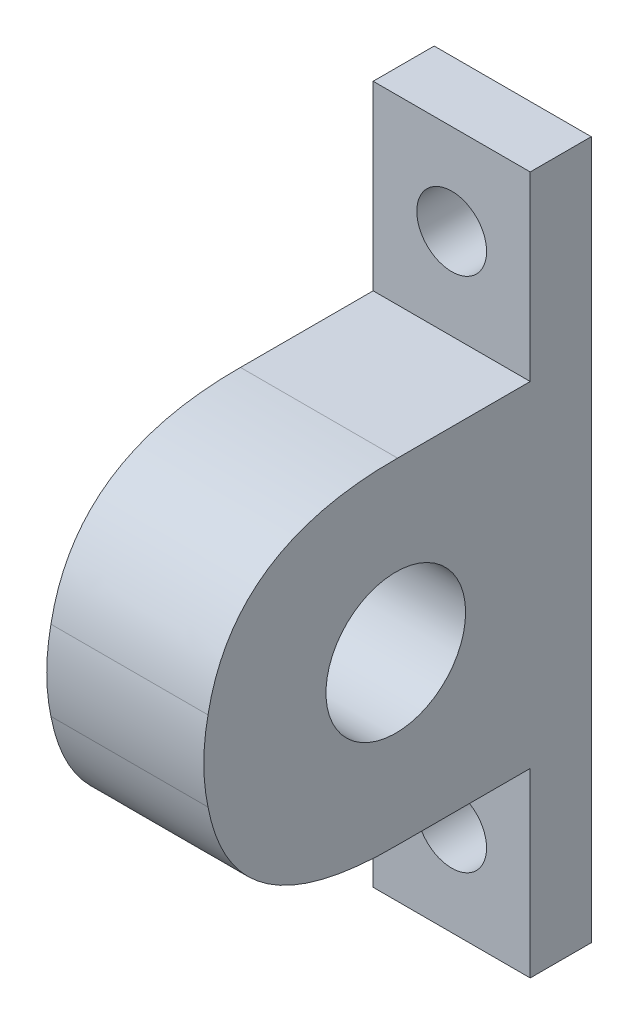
ISO-10303-21;
HEADER;
FILE_DESCRIPTION(('STEP AP214'),'2;1');
FILE_NAME('part.step','',(''),(''),'','','');
FILE_SCHEMA(('AUTOMOTIVE_DESIGN { 1 0 10303 214 1 1 1 1 }'));
ENDSEC;
DATA;
#1=APPLICATION_CONTEXT('core data for automotive mechanical design processes');
#2=APPLICATION_PROTOCOL_DEFINITION('international standard','automotive_design',2000,#1);
#3=PRODUCT_CONTEXT('',#1,'mechanical');
#4=PRODUCT('Part','Part','',(#3));
#5=PRODUCT_RELATED_PRODUCT_CATEGORY('part','',(#4));
#6=PRODUCT_DEFINITION_FORMATION('','',#4);
#7=PRODUCT_DEFINITION_CONTEXT('part definition',#1,'design');
#8=PRODUCT_DEFINITION('design','',#6,#7);
#9=PRODUCT_DEFINITION_SHAPE('','',#8);
#10=(LENGTH_UNIT() NAMED_UNIT(*) SI_UNIT(.MILLI.,.METRE.));
#11=(NAMED_UNIT(*) PLANE_ANGLE_UNIT() SI_UNIT($,.RADIAN.));
#12=(NAMED_UNIT(*) SI_UNIT($,.STERADIAN.) SOLID_ANGLE_UNIT());
#13=UNCERTAINTY_MEASURE_WITH_UNIT(LENGTH_MEASURE(1.E-05),#10,'distance_accuracy_value','');
#14=(GEOMETRIC_REPRESENTATION_CONTEXT(3) GLOBAL_UNCERTAINTY_ASSIGNED_CONTEXT((#13)) GLOBAL_UNIT_ASSIGNED_CONTEXT((#10,
#11,#12)) REPRESENTATION_CONTEXT('',''));
#15=CARTESIAN_POINT('',(0.,0.,0.));
#16=DIRECTION('',(0.,0.,1.));
#17=DIRECTION('',(1.,0.,0.));
#18=AXIS2_PLACEMENT_3D('',#15,#16,#17);
#19=CARTESIAN_POINT('',(22.5,-50.,8.7420219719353));
#20=DIRECTION('',(1.,0.,0.));
#21=DIRECTION('',(0.,0.,-1.));
#22=AXIS2_PLACEMENT_3D('',#19,#20,#21);
#23=PLANE('',#22);
#24=CARTESIAN_POINT('',(22.5,0.,28.));
#25=DIRECTION('',(1.,0.,0.));
#26=DIRECTION('',(0.,0.,-1.));
#27=AXIS2_PLACEMENT_3D('',#24,#25,#26);
#28=CIRCLE('',#27,10.);
#29=CARTESIAN_POINT('',(22.5,0.,18.));
#30=VERTEX_POINT('',#29);
#31=EDGE_CURVE('E51',#30,#30,#28,.F.);
#32=ORIENTED_EDGE('',*,*,#31,.T.);
#33=EDGE_LOOP('',(#32));
#34=FACE_BOUND('',#33,.T.);
#35=DIRECTION('',(0.,-1.,0.));
#36=VECTOR('',#35,1.);
#37=CARTESIAN_POINT('',(22.5,0.,8.7420219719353));
#38=LINE('',#37,#36);
#39=CARTESIAN_POINT('',(22.5,-24.,8.7420219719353));
#40=VERTEX_POINT('',#39);
#41=CARTESIAN_POINT('',(22.5,-50.,8.7420219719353));
#42=VERTEX_POINT('',#41);
#43=EDGE_CURVE('E223',#40,#42,#38,.T.);
#44=ORIENTED_EDGE('',*,*,#43,.T.);
#45=DIRECTION('',(0.,0.,-1.));
#46=VECTOR('',#45,1.);
#47=CARTESIAN_POINT('',(22.5,-50.,55.5));
#48=LINE('',#47,#46);
#49=CARTESIAN_POINT('',(22.5,-50.,0.));
#50=VERTEX_POINT('',#49);
#51=EDGE_CURVE('E146',#42,#50,#48,.T.);
#52=ORIENTED_EDGE('',*,*,#51,.T.);
#53=DIRECTION('',(0.,1.,0.));
#54=VECTOR('',#53,1.);
#55=CARTESIAN_POINT('',(22.5,-50.,0.));
#56=LINE('',#55,#54);
#57=CARTESIAN_POINT('',(22.5,50.,0.));
#58=VERTEX_POINT('',#57);
#59=EDGE_CURVE('E145',#50,#58,#56,.T.);
#60=ORIENTED_EDGE('',*,*,#59,.T.);
#61=DIRECTION('',(0.,0.,-1.));
#62=VECTOR('',#61,1.);
#63=CARTESIAN_POINT('',(22.5,50.,55.5));
#64=LINE('',#63,#62);
#65=CARTESIAN_POINT('',(22.5,50.,8.7420219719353));
#66=VERTEX_POINT('',#65);
#67=EDGE_CURVE('E135',#66,#58,#64,.T.);
#68=ORIENTED_EDGE('',*,*,#67,.F.);
#69=DIRECTION('',(0.,1.,0.));
#70=VECTOR('',#69,1.);
#71=CARTESIAN_POINT('',(22.5,0.,8.7420219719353));
#72=LINE('',#71,#70);
#73=CARTESIAN_POINT('',(22.5,24.,8.7420219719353));
#74=VERTEX_POINT('',#73);
#75=EDGE_CURVE('E174',#74,#66,#72,.T.);
#76=ORIENTED_EDGE('',*,*,#75,.F.);
#77=DIRECTION('',(0.,0.,1.));
#78=VECTOR('',#77,1.);
#79=CARTESIAN_POINT('',(22.5,24.,0.));
#80=LINE('',#79,#78);
#81=CARTESIAN_POINT('',(22.5,24.,27.75));
#82=VERTEX_POINT('',#81);
#83=EDGE_CURVE('E294',#74,#82,#80,.T.);
#84=ORIENTED_EDGE('',*,*,#83,.T.);
#85=CARTESIAN_POINT('',(22.5,0.,55.5));
#86=CARTESIAN_POINT('',(22.5,24.2004229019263,54.7772443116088));
#87=CARTESIAN_POINT('',(22.5,24.,27.75));
#88=B_SPLINE_CURVE_WITH_KNOTS('',2,(#85,#86,#87),.UNSPECIFIED.,.F.,.F.,(3,3),(0.,1.),.UNSPECIFIED.);
#89=CARTESIAN_POINT('',(22.5,5.71932993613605,54.8986851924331));
#90=VERTEX_POINT('',#89);
#91=EDGE_CURVE('E166',#90,#82,#88,.T.);
#92=ORIENTED_EDGE('',*,*,#91,.F.);
#93=CARTESIAN_POINT('',(22.5,0.,28.));
#94=DIRECTION('',(1.,0.,0.));
#95=DIRECTION('',(0.,0.,-1.));
#96=AXIS2_PLACEMENT_3D('',#93,#94,#95);
#97=CIRCLE('',#96,27.5);
#98=CARTESIAN_POINT('',(22.5,-5.7193299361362,54.898685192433));
#99=VERTEX_POINT('',#98);
#100=EDGE_CURVE('E162',#90,#99,#97,.T.);
#101=ORIENTED_EDGE('',*,*,#100,.T.);
#102=CARTESIAN_POINT('',(22.5,0.,55.5));
#103=CARTESIAN_POINT('',(22.5,-24.2004229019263,54.7772443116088));
#104=CARTESIAN_POINT('',(22.5,-24.,27.75));
#105=B_SPLINE_CURVE_WITH_KNOTS('',2,(#102,#103,#104),.UNSPECIFIED.,.F.,.F.,(3,3),(0.,1.),.UNSPECIFIED.);
#106=CARTESIAN_POINT('',(22.5,-24.,27.75));
#107=VERTEX_POINT('',#106);
#108=EDGE_CURVE('E321',#99,#107,#105,.T.);
#109=ORIENTED_EDGE('',*,*,#108,.T.);
#110=DIRECTION('',(0.,0.,1.));
#111=VECTOR('',#110,1.);
#112=CARTESIAN_POINT('',(22.5,-24.,0.));
#113=LINE('',#112,#111);
#114=EDGE_CURVE('E233',#40,#107,#113,.T.);
#115=ORIENTED_EDGE('',*,*,#114,.F.);
#116=EDGE_LOOP('',(#44,#52,#60,#68,#76,#84,#92,#101,#109,#115));
#117=FACE_BOUND('',#116,.T.);
#118=ADVANCED_FACE('F47',(#34,#117),#23,.T.);
#119=CARTESIAN_POINT('',(0.,0.,28.));
#120=DIRECTION('',(1.,0.,0.));
#121=DIRECTION('',(0.,0.,-1.));
#122=AXIS2_PLACEMENT_3D('',#119,#120,#121);
#123=CYLINDRICAL_SURFACE('',#122,10.);
#124=CARTESIAN_POINT('',(-5.,0.,28.));
#125=DIRECTION('',(-1.,0.,0.));
#126=DIRECTION('',(0.,0.,1.));
#127=AXIS2_PLACEMENT_3D('',#124,#125,#126);
#128=CIRCLE('',#127,10.);
#129=CARTESIAN_POINT('',(-5.,0.,18.));
#130=VERTEX_POINT('',#129);
#131=EDGE_CURVE('E11',#130,#130,#128,.F.);
#132=CARTESIAN_POINT('',(-5.,0.,18.));
#133=CARTESIAN_POINT('',(-4.71354166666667,0.,18.));
#134=CARTESIAN_POINT('',(-4.42708333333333,0.,18.));
#135=CARTESIAN_POINT('',(-3.85416666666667,0.,18.));
#136=CARTESIAN_POINT('',(-3.56770833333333,0.,18.));
#137=CARTESIAN_POINT('',(-2.99479166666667,0.,18.));
#138=CARTESIAN_POINT('',(-2.70833333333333,0.,18.));
#139=CARTESIAN_POINT('',(-2.13541666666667,0.,18.));
#140=CARTESIAN_POINT('',(-1.84895833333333,0.,18.));
#141=CARTESIAN_POINT('',(-1.27604166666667,0.,18.));
#142=CARTESIAN_POINT('',(-0.989583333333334,0.,18.));
#143=CARTESIAN_POINT('',(-0.416666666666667,0.,18.));
#144=CARTESIAN_POINT('',(-0.130208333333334,0.,18.));
#145=CARTESIAN_POINT('',(0.442708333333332,0.,18.));
#146=CARTESIAN_POINT('',(0.729166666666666,0.,18.));
#147=CARTESIAN_POINT('',(1.30208333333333,0.,18.));
#148=CARTESIAN_POINT('',(1.58854166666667,0.,18.));
#149=CARTESIAN_POINT('',(2.16145833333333,0.,18.));
#150=CARTESIAN_POINT('',(2.44791666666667,0.,18.));
#151=CARTESIAN_POINT('',(3.02083333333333,0.,18.));
#152=CARTESIAN_POINT('',(3.30729166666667,0.,18.));
#153=CARTESIAN_POINT('',(3.88020833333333,0.,18.));
#154=CARTESIAN_POINT('',(4.16666666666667,0.,18.));
#155=CARTESIAN_POINT('',(4.73958333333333,0.,18.));
#156=CARTESIAN_POINT('',(5.02604166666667,0.,18.));
#157=CARTESIAN_POINT('',(5.59895833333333,0.,18.));
#158=CARTESIAN_POINT('',(5.88541666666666,0.,18.));
#159=CARTESIAN_POINT('',(6.45833333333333,0.,18.));
#160=CARTESIAN_POINT('',(6.74479166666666,0.,18.));
#161=CARTESIAN_POINT('',(7.31770833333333,0.,18.));
#162=CARTESIAN_POINT('',(7.60416666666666,0.,18.));
#163=CARTESIAN_POINT('',(8.17708333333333,0.,18.));
#164=CARTESIAN_POINT('',(8.46354166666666,0.,18.));
#165=CARTESIAN_POINT('',(9.03645833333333,0.,18.));
#166=CARTESIAN_POINT('',(9.32291666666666,0.,18.));
#167=CARTESIAN_POINT('',(9.89583333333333,0.,18.));
#168=CARTESIAN_POINT('',(10.1822916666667,0.,18.));
#169=CARTESIAN_POINT('',(10.7552083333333,0.,18.));
#170=CARTESIAN_POINT('',(11.0416666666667,0.,18.));
#171=CARTESIAN_POINT('',(11.6145833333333,0.,18.));
#172=CARTESIAN_POINT('',(11.9010416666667,0.,18.));
#173=CARTESIAN_POINT('',(12.4739583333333,0.,18.));
#174=CARTESIAN_POINT('',(12.7604166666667,0.,18.));
#175=CARTESIAN_POINT('',(13.3333333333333,0.,18.));
#176=CARTESIAN_POINT('',(13.6197916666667,0.,18.));
#177=CARTESIAN_POINT('',(14.1927083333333,0.,18.));
#178=CARTESIAN_POINT('',(14.4791666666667,0.,18.));
#179=CARTESIAN_POINT('',(15.0520833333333,0.,18.));
#180=CARTESIAN_POINT('',(15.3385416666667,0.,18.));
#181=CARTESIAN_POINT('',(15.9114583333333,0.,18.));
#182=CARTESIAN_POINT('',(16.1979166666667,0.,18.));
#183=CARTESIAN_POINT('',(16.7708333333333,0.,18.));
#184=CARTESIAN_POINT('',(17.0572916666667,0.,18.));
#185=CARTESIAN_POINT('',(17.6302083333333,0.,18.));
#186=CARTESIAN_POINT('',(17.9166666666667,0.,18.));
#187=CARTESIAN_POINT('',(18.4895833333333,0.,18.));
#188=CARTESIAN_POINT('',(18.7760416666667,0.,18.));
#189=CARTESIAN_POINT('',(19.3489583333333,0.,18.));
#190=CARTESIAN_POINT('',(19.6354166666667,0.,18.));
#191=CARTESIAN_POINT('',(20.2083333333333,0.,18.));
#192=CARTESIAN_POINT('',(20.4947916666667,0.,18.));
#193=CARTESIAN_POINT('',(21.0677083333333,0.,18.));
#194=CARTESIAN_POINT('',(21.3541666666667,0.,18.));
#195=CARTESIAN_POINT('',(21.9270833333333,0.,18.));
#196=CARTESIAN_POINT('',(22.2135416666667,0.,18.));
#197=CARTESIAN_POINT('',(22.5,0.,18.));
#198=B_SPLINE_CURVE_WITH_KNOTS('',3,(#132,#133,#134,#135,#136,#137,#138,#139,#140,#141,#142,
#143,#144,#145,#146,#147,#148,#149,#150,#151,#152,#153,#154,#155,#156,#157,#158,#159,#160,#161,
#162,#163,#164,#165,#166,#167,#168,#169,#170,#171,#172,#173,#174,#175,#176,#177,#178,#179,#180,
#181,#182,#183,#184,#185,#186,#187,#188,#189,#190,#191,#192,#193,#194,#195,#196,#197),
.UNSPECIFIED.,.F.,.F.,(4,2,2,2,2,2,2,2,2,2,2,2,2,2,2,2,2,2,2,2,2,2,2,2,2,2,2,2,2,2,2,2,4),(0.,
0.859375,1.71875,2.578125,3.4375,4.296875,5.15625,6.015625,6.875,7.734375,8.59375,9.453125,
10.3125,11.171875,12.03125,12.890625,13.75,14.609375,15.46875,16.328125,17.1875,18.046875,
18.90625,19.765625,20.625,21.484375,22.34375,23.203125,24.0625,24.921875,25.78125,26.640625,
27.5),.UNSPECIFIED.);
#199=EDGE_CURVE('BSEAM49',#130,#30,#198,.T.);
#200=ORIENTED_EDGE('',*,*,#131,.F.);
#201=ORIENTED_EDGE('',*,*,#31,.F.);
#202=ORIENTED_EDGE('',*,*,#199,.T.);
#203=ORIENTED_EDGE('',*,*,#199,.F.);
#204=EDGE_LOOP('',(#200,#202,#201,#203));
#205=FACE_BOUND('',#204,.T.);
#206=ADVANCED_FACE('F49',(#205),#123,.F.);
#207=CARTESIAN_POINT('',(0.,-50.,55.5));
#208=DIRECTION('',(1.,0.,0.));
#209=DIRECTION('',(0.,0.,-1.));
#210=AXIS2_PLACEMENT_3D('',#207,#208,#209);
#211=PLANE('',#210);
#212=CARTESIAN_POINT('',(0.,0.,28.));
#213=DIRECTION('',(1.,0.,0.));
#214=DIRECTION('',(0.,0.,-1.));
#215=AXIS2_PLACEMENT_3D('',#212,#213,#214);
#216=CIRCLE('',#215,12.);
#217=CARTESIAN_POINT('',(0.,0.,16.));
#218=VERTEX_POINT('',#217);
#219=EDGE_CURVE('E254',#218,#218,#216,.F.);
#220=ORIENTED_EDGE('',*,*,#219,.F.);
#221=EDGE_LOOP('',(#220));
#222=FACE_BOUND('',#221,.T.);
#223=DIRECTION('',(0.,-1.,0.));
#224=VECTOR('',#223,1.);
#225=CARTESIAN_POINT('',(0.,0.,8.7420219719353));
#226=LINE('',#225,#224);
#227=CARTESIAN_POINT('',(0.,-24.,8.7420219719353));
#228=VERTEX_POINT('',#227);
#229=CARTESIAN_POINT('',(0.,-50.,8.7420219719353));
#230=VERTEX_POINT('',#229);
#231=EDGE_CURVE('E215',#228,#230,#226,.T.);
#232=ORIENTED_EDGE('',*,*,#231,.F.);
#233=DIRECTION('',(0.,0.,1.));
#234=VECTOR('',#233,1.);
#235=CARTESIAN_POINT('',(0.,-24.,0.));
#236=LINE('',#235,#234);
#237=CARTESIAN_POINT('',(0.,-24.,27.75));
#238=VERTEX_POINT('',#237);
#239=EDGE_CURVE('E214',#228,#238,#236,.T.);
#240=ORIENTED_EDGE('',*,*,#239,.T.);
#241=CARTESIAN_POINT('',(0.,0.,55.5));
#242=CARTESIAN_POINT('',(0.,-24.2004229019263,54.7772443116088));
#243=CARTESIAN_POINT('',(0.,-24.,27.75));
#244=B_SPLINE_CURVE_WITH_KNOTS('',2,(#241,#242,#243),.UNSPECIFIED.,.F.,.F.,(3,3),(0.,1.),.UNSPECIFIED.);
#245=CARTESIAN_POINT('',(0.,-5.7193299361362,54.898685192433));
#246=VERTEX_POINT('',#245);
#247=EDGE_CURVE('E89',#246,#238,#244,.T.);
#248=ORIENTED_EDGE('',*,*,#247,.F.);
#249=CARTESIAN_POINT('',(0.,0.,28.));
#250=DIRECTION('',(1.,0.,0.));
#251=DIRECTION('',(0.,0.,-1.));
#252=AXIS2_PLACEMENT_3D('',#249,#250,#251);
#253=CIRCLE('',#252,27.5);
#254=CARTESIAN_POINT('',(0.,5.71932993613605,54.8986851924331));
#255=VERTEX_POINT('',#254);
#256=EDGE_CURVE('E85',#255,#246,#253,.T.);
#257=ORIENTED_EDGE('',*,*,#256,.F.);
#258=CARTESIAN_POINT('',(0.,0.,55.5));
#259=CARTESIAN_POINT('',(0.,24.2004229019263,54.7772443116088));
#260=CARTESIAN_POINT('',(0.,24.,27.75));
#261=B_SPLINE_CURVE_WITH_KNOTS('',2,(#258,#259,#260),.UNSPECIFIED.,.F.,.F.,(3,3),(0.,1.),.UNSPECIFIED.);
#262=CARTESIAN_POINT('',(0.,24.,27.75));
#263=VERTEX_POINT('',#262);
#264=EDGE_CURVE('E173',#255,#263,#261,.T.);
#265=ORIENTED_EDGE('',*,*,#264,.T.);
#266=DIRECTION('',(0.,0.,1.));
#267=VECTOR('',#266,1.);
#268=CARTESIAN_POINT('',(0.,24.,0.));
#269=LINE('',#268,#267);
#270=CARTESIAN_POINT('',(0.,24.,8.7420219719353));
#271=VERTEX_POINT('',#270);
#272=EDGE_CURVE('E181',#271,#263,#269,.T.);
#273=ORIENTED_EDGE('',*,*,#272,.F.);
#274=DIRECTION('',(0.,1.,0.));
#275=VECTOR('',#274,1.);
#276=CARTESIAN_POINT('',(0.,0.,8.7420219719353));
#277=LINE('',#276,#275);
#278=CARTESIAN_POINT('',(0.,50.,8.7420219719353));
#279=VERTEX_POINT('',#278);
#280=EDGE_CURVE('E280',#271,#279,#277,.T.);
#281=ORIENTED_EDGE('',*,*,#280,.T.);
#282=DIRECTION('',(0.,0.,-1.));
#283=VECTOR('',#282,1.);
#284=CARTESIAN_POINT('',(0.,50.,55.5));
#285=LINE('',#284,#283);
#286=CARTESIAN_POINT('',(0.,50.,0.));
#287=VERTEX_POINT('',#286);
#288=EDGE_CURVE('E257',#279,#287,#285,.T.);
#289=ORIENTED_EDGE('',*,*,#288,.T.);
#290=DIRECTION('',(0.,-1.,0.));
#291=VECTOR('',#290,1.);
#292=CARTESIAN_POINT('',(0.,-50.,0.));
#293=LINE('',#292,#291);
#294=CARTESIAN_POINT('',(0.,-50.,0.));
#295=VERTEX_POINT('',#294);
#296=EDGE_CURVE('E160',#287,#295,#293,.T.);
#297=ORIENTED_EDGE('',*,*,#296,.T.);
#298=DIRECTION('',(0.,0.,-1.));
#299=VECTOR('',#298,1.);
#300=CARTESIAN_POINT('',(0.,-50.,55.5));
#301=LINE('',#300,#299);
#302=EDGE_CURVE('E261',#230,#295,#301,.T.);
#303=ORIENTED_EDGE('',*,*,#302,.F.);
#304=EDGE_LOOP('',(#232,#240,#248,#257,#265,#273,#281,#289,#297,#303));
#305=FACE_BOUND('',#304,.T.);
#306=ADVANCED_FACE('F276',(#222,#305),#211,.F.);
#307=CARTESIAN_POINT('',(0.,-50.,55.5));
#308=DIRECTION('',(0.,1.,0.));
#309=DIRECTION('',(0.,0.,1.));
#310=AXIS2_PLACEMENT_3D('',#307,#308,#309);
#311=PLANE('',#310);
#312=DIRECTION('',(1.,0.,0.));
#313=VECTOR('',#312,1.);
#314=CARTESIAN_POINT('',(0.,-50.,8.7420219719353));
#315=LINE('',#314,#313);
#316=EDGE_CURVE('E273',#230,#42,#315,.T.);
#317=ORIENTED_EDGE('',*,*,#316,.F.);
#318=ORIENTED_EDGE('',*,*,#302,.T.);
#319=DIRECTION('',(1.,0.,0.));
#320=VECTOR('',#319,1.);
#321=CARTESIAN_POINT('',(0.,-50.,0.));
#322=LINE('',#321,#320);
#323=EDGE_CURVE('E155',#295,#50,#322,.T.);
#324=ORIENTED_EDGE('',*,*,#323,.T.);
#325=ORIENTED_EDGE('',*,*,#51,.F.);
#326=EDGE_LOOP('',(#317,#318,#324,#325));
#327=FACE_BOUND('',#326,.T.);
#328=ADVANCED_FACE('F271',(#327),#311,.F.);
#329=CARTESIAN_POINT('',(22.5,50.,55.5));
#330=DIRECTION('',(0.,-1.,0.));
#331=DIRECTION('',(0.,0.,-1.));
#332=AXIS2_PLACEMENT_3D('',#329,#330,#331);
#333=PLANE('',#332);
#334=ORIENTED_EDGE('',*,*,#288,.F.);
#335=DIRECTION('',(1.,0.,0.));
#336=VECTOR('',#335,1.);
#337=CARTESIAN_POINT('',(0.,50.,8.7420219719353));
#338=LINE('',#337,#336);
#339=EDGE_CURVE('E141',#279,#66,#338,.T.);
#340=ORIENTED_EDGE('',*,*,#339,.T.);
#341=ORIENTED_EDGE('',*,*,#67,.T.);
#342=DIRECTION('',(-1.,0.,0.));
#343=VECTOR('',#342,1.);
#344=CARTESIAN_POINT('',(22.5,50.,0.));
#345=LINE('',#344,#343);
#346=EDGE_CURVE('E140',#58,#287,#345,.T.);
#347=ORIENTED_EDGE('',*,*,#346,.T.);
#348=EDGE_LOOP('',(#334,#340,#341,#347));
#349=FACE_BOUND('',#348,.T.);
#350=ADVANCED_FACE('F138',(#349),#333,.F.);
#351=CARTESIAN_POINT('',(0.,0.,0.));
#352=DIRECTION('',(0.,0.,-1.));
#353=DIRECTION('',(-1.,0.,0.));
#354=AXIS2_PLACEMENT_3D('',#351,#352,#353);
#355=PLANE('',#354);
#356=CARTESIAN_POINT('',(11.25,-37.,0.));
#357=DIRECTION('',(0.,0.,1.));
#358=DIRECTION('',(1.,0.,0.));
#359=AXIS2_PLACEMENT_3D('',#356,#357,#358);
#360=CIRCLE('',#359,4.99843798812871);
#361=CARTESIAN_POINT('',(16.2484379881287,-37.,0.));
#362=VERTEX_POINT('',#361);
#363=EDGE_CURVE('E228',#362,#362,#360,.T.);
#364=ORIENTED_EDGE('',*,*,#363,.T.);
#365=EDGE_LOOP('',(#364));
#366=FACE_BOUND('',#365,.T.);
#367=CARTESIAN_POINT('',(11.25,37.,0.));
#368=DIRECTION('',(0.,0.,1.));
#369=DIRECTION('',(1.,0.,0.));
#370=AXIS2_PLACEMENT_3D('',#367,#368,#369);
#371=CIRCLE('',#370,5.);
#372=CARTESIAN_POINT('',(16.25,37.,0.));
#373=VERTEX_POINT('',#372);
#374=EDGE_CURVE('E229',#373,#373,#371,.T.);
#375=ORIENTED_EDGE('',*,*,#374,.T.);
#376=EDGE_LOOP('',(#375));
#377=FACE_BOUND('',#376,.T.);
#378=ORIENTED_EDGE('',*,*,#346,.F.);
#379=ORIENTED_EDGE('',*,*,#59,.F.);
#380=ORIENTED_EDGE('',*,*,#323,.F.);
#381=ORIENTED_EDGE('',*,*,#296,.F.);
#382=EDGE_LOOP('',(#378,#379,#380,#381));
#383=FACE_BOUND('',#382,.T.);
#384=ADVANCED_FACE('F158',(#366,#377,#383),#355,.T.);
#385=CARTESIAN_POINT('',(0.,0.,28.));
#386=DIRECTION('',(1.,0.,0.));
#387=DIRECTION('',(0.,0.,-1.));
#388=AXIS2_PLACEMENT_3D('',#385,#386,#387);
#389=CYLINDRICAL_SURFACE('',#388,27.5);
#390=ORIENTED_EDGE('',*,*,#100,.F.);
#391=DIRECTION('',(1.,0.,0.));
#392=VECTOR('',#391,1.);
#393=CARTESIAN_POINT('',(0.,5.71932993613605,54.8986851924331));
#394=LINE('',#393,#392);
#395=EDGE_CURVE('E283',#255,#90,#394,.T.);
#396=ORIENTED_EDGE('',*,*,#395,.F.);
#397=ORIENTED_EDGE('',*,*,#256,.T.);
#398=DIRECTION('',(1.,0.,0.));
#399=VECTOR('',#398,1.);
#400=CARTESIAN_POINT('',(0.,-5.7193299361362,54.898685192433));
#401=LINE('',#400,#399);
#402=EDGE_CURVE('E312',#246,#99,#401,.T.);
#403=ORIENTED_EDGE('',*,*,#402,.T.);
#404=EDGE_LOOP('',(#390,#396,#397,#403));
#405=FACE_BOUND('',#404,.T.);
#406=ADVANCED_FACE('F195',(#405),#389,.T.);
#407=CARTESIAN_POINT('',(0.,0.,8.7420219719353));
#408=DIRECTION('',(0.,0.,-1.));
#409=DIRECTION('',(0.,1.,0.));
#410=AXIS2_PLACEMENT_3D('',#407,#408,#409);
#411=PLANE('',#410);
#412=CARTESIAN_POINT('',(11.25,37.,8.7420219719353));
#413=DIRECTION('',(0.,0.,1.));
#414=DIRECTION('',(1.,0.,0.));
#415=AXIS2_PLACEMENT_3D('',#412,#413,#414);
#416=CIRCLE('',#415,5.);
#417=CARTESIAN_POINT('',(16.25,37.,8.7420219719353));
#418=VERTEX_POINT('',#417);
#419=EDGE_CURVE('E224',#418,#418,#416,.T.);
#420=ORIENTED_EDGE('',*,*,#419,.F.);
#421=EDGE_LOOP('',(#420));
#422=FACE_BOUND('',#421,.T.);
#423=ORIENTED_EDGE('',*,*,#75,.T.);
#424=ORIENTED_EDGE('',*,*,#339,.F.);
#425=ORIENTED_EDGE('',*,*,#280,.F.);
#426=DIRECTION('',(1.,0.,0.));
#427=VECTOR('',#426,1.);
#428=CARTESIAN_POINT('',(0.,24.,8.7420219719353));
#429=LINE('',#428,#427);
#430=EDGE_CURVE('E305',#271,#74,#429,.T.);
#431=ORIENTED_EDGE('',*,*,#430,.T.);
#432=EDGE_LOOP('',(#423,#424,#425,#431));
#433=FACE_BOUND('',#432,.T.);
#434=ADVANCED_FACE('F198',(#422,#433),#411,.F.);
#435=CARTESIAN_POINT('',(0.,24.,0.));
#436=DIRECTION('',(0.,1.,0.));
#437=DIRECTION('',(0.,0.,1.));
#438=AXIS2_PLACEMENT_3D('',#435,#436,#437);
#439=PLANE('',#438);
#440=ORIENTED_EDGE('',*,*,#83,.F.);
#441=ORIENTED_EDGE('',*,*,#430,.F.);
#442=ORIENTED_EDGE('',*,*,#272,.T.);
#443=DIRECTION('',(1.,0.,0.));
#444=VECTOR('',#443,1.);
#445=CARTESIAN_POINT('',(0.,24.,27.75));
#446=LINE('',#445,#444);
#447=EDGE_CURVE('E286',#263,#82,#446,.T.);
#448=ORIENTED_EDGE('',*,*,#447,.T.);
#449=EDGE_LOOP('',(#440,#441,#442,#448));
#450=FACE_BOUND('',#449,.T.);
#451=ADVANCED_FACE('F192',(#450),#439,.T.);
#452=DIRECTION('',(1.,0.,0.));
#453=VECTOR('',#452,1.);
#454=SURFACE_OF_LINEAR_EXTRUSION('',#261,#453);
#455=ORIENTED_EDGE('',*,*,#91,.T.);
#456=ORIENTED_EDGE('',*,*,#447,.F.);
#457=ORIENTED_EDGE('',*,*,#264,.F.);
#458=ORIENTED_EDGE('',*,*,#395,.T.);
#459=EDGE_LOOP('',(#455,#456,#457,#458));
#460=FACE_BOUND('',#459,.T.);
#461=ADVANCED_FACE('F187',(#460),#454,.F.);
#462=CARTESIAN_POINT('',(0.,-24.,0.));
#463=DIRECTION('',(0.,1.,0.));
#464=DIRECTION('',(0.,0.,1.));
#465=AXIS2_PLACEMENT_3D('',#462,#463,#464);
#466=PLANE('',#465);
#467=ORIENTED_EDGE('',*,*,#114,.T.);
#468=DIRECTION('',(1.,0.,0.));
#469=VECTOR('',#468,1.);
#470=CARTESIAN_POINT('',(0.,-24.,27.75));
#471=LINE('',#470,#469);
#472=EDGE_CURVE('E66',#238,#107,#471,.T.);
#473=ORIENTED_EDGE('',*,*,#472,.F.);
#474=ORIENTED_EDGE('',*,*,#239,.F.);
#475=DIRECTION('',(1.,0.,0.));
#476=VECTOR('',#475,1.);
#477=CARTESIAN_POINT('',(0.,-24.,8.7420219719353));
#478=LINE('',#477,#476);
#479=EDGE_CURVE('E94',#228,#40,#478,.T.);
#480=ORIENTED_EDGE('',*,*,#479,.T.);
#481=EDGE_LOOP('',(#467,#473,#474,#480));
#482=FACE_BOUND('',#481,.T.);
#483=ADVANCED_FACE('F191',(#482),#466,.F.);
#484=CARTESIAN_POINT('',(0.,0.,8.7420219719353));
#485=DIRECTION('',(0.,0.,1.));
#486=DIRECTION('',(0.,-1.,0.));
#487=AXIS2_PLACEMENT_3D('',#484,#485,#486);
#488=PLANE('',#487);
#489=CARTESIAN_POINT('',(11.25,-37.,8.7420219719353));
#490=DIRECTION('',(0.,0.,1.));
#491=DIRECTION('',(1.,0.,0.));
#492=AXIS2_PLACEMENT_3D('',#489,#490,#491);
#493=CIRCLE('',#492,4.99843798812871);
#494=CARTESIAN_POINT('',(16.2484379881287,-37.,8.7420219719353));
#495=VERTEX_POINT('',#494);
#496=EDGE_CURVE('E234',#495,#495,#493,.T.);
#497=ORIENTED_EDGE('',*,*,#496,.F.);
#498=EDGE_LOOP('',(#497));
#499=FACE_BOUND('',#498,.T.);
#500=ORIENTED_EDGE('',*,*,#43,.F.);
#501=ORIENTED_EDGE('',*,*,#479,.F.);
#502=ORIENTED_EDGE('',*,*,#231,.T.);
#503=ORIENTED_EDGE('',*,*,#316,.T.);
#504=EDGE_LOOP('',(#500,#501,#502,#503));
#505=FACE_BOUND('',#504,.T.);
#506=ADVANCED_FACE('F201',(#499,#505),#488,.T.);
#507=DIRECTION('',(1.,0.,0.));
#508=VECTOR('',#507,1.);
#509=SURFACE_OF_LINEAR_EXTRUSION('',#244,#508);
#510=ORIENTED_EDGE('',*,*,#108,.F.);
#511=ORIENTED_EDGE('',*,*,#402,.F.);
#512=ORIENTED_EDGE('',*,*,#247,.T.);
#513=ORIENTED_EDGE('',*,*,#472,.T.);
#514=EDGE_LOOP('',(#510,#511,#512,#513));
#515=FACE_BOUND('',#514,.T.);
#516=ADVANCED_FACE('F202',(#515),#509,.T.);
#517=CARTESIAN_POINT('',(11.25,37.,0.));
#518=DIRECTION('',(0.,0.,1.));
#519=DIRECTION('',(1.,0.,0.));
#520=AXIS2_PLACEMENT_3D('',#517,#518,#519);
#521=CYLINDRICAL_SURFACE('',#520,5.);
#522=ORIENTED_EDGE('',*,*,#374,.F.);
#523=EDGE_LOOP('',(#522));
#524=FACE_BOUND('',#523,.T.);
#525=ORIENTED_EDGE('',*,*,#419,.T.);
#526=EDGE_LOOP('',(#525));
#527=FACE_BOUND('',#526,.T.);
#528=ADVANCED_FACE('F206',(#524,#527),#521,.F.);
#529=CARTESIAN_POINT('',(11.25,-37.,0.));
#530=DIRECTION('',(0.,0.,1.));
#531=DIRECTION('',(1.,0.,0.));
#532=AXIS2_PLACEMENT_3D('',#529,#530,#531);
#533=CYLINDRICAL_SURFACE('',#532,4.99843798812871);
#534=ORIENTED_EDGE('',*,*,#363,.F.);
#535=EDGE_LOOP('',(#534));
#536=FACE_BOUND('',#535,.T.);
#537=ORIENTED_EDGE('',*,*,#496,.T.);
#538=EDGE_LOOP('',(#537));
#539=FACE_BOUND('',#538,.T.);
#540=ADVANCED_FACE('F250',(#536,#539),#533,.F.);
#541=CARTESIAN_POINT('',(-5.,0.,28.));
#542=DIRECTION('',(1.,0.,0.));
#543=DIRECTION('',(0.,0.,-1.));
#544=AXIS2_PLACEMENT_3D('',#541,#542,#543);
#545=CYLINDRICAL_SURFACE('',#544,12.);
#546=CARTESIAN_POINT('',(-5.,0.,28.));
#547=DIRECTION('',(-1.,0.,0.));
#548=DIRECTION('',(0.,0.,1.));
#549=AXIS2_PLACEMENT_3D('',#546,#547,#548);
#550=CIRCLE('',#549,12.);
#551=CARTESIAN_POINT('',(-5.,0.,40.));
#552=VERTEX_POINT('',#551);
#553=EDGE_CURVE('E58',#552,#552,#550,.T.);
#554=ORIENTED_EDGE('',*,*,#553,.F.);
#555=EDGE_LOOP('',(#554));
#556=FACE_BOUND('',#555,.T.);
#557=ORIENTED_EDGE('',*,*,#219,.T.);
#558=EDGE_LOOP('',(#557));
#559=FACE_BOUND('',#558,.T.);
#560=ADVANCED_FACE('F247',(#556,#559),#545,.T.);
#561=CARTESIAN_POINT('',(-5.,0.,0.));
#562=DIRECTION('',(-1.,0.,0.));
#563=DIRECTION('',(0.,0.,1.));
#564=AXIS2_PLACEMENT_3D('',#561,#562,#563);
#565=PLANE('',#564);
#566=ORIENTED_EDGE('',*,*,#131,.T.);
#567=EDGE_LOOP('',(#566));
#568=FACE_BOUND('',#567,.T.);
#569=ORIENTED_EDGE('',*,*,#553,.T.);
#570=EDGE_LOOP('',(#569));
#571=FACE_BOUND('',#570,.T.);
#572=ADVANCED_FACE('F245',(#568,#571),#565,.T.);
#573=CLOSED_SHELL('',(#118,#206,#306,#328,#350,#384,#406,#434,#451,#461,#483,#506,#516,#528,
#540,#560,#572));
#574=MANIFOLD_SOLID_BREP('B2',#573);
#575=ADVANCED_BREP_SHAPE_REPRESENTATION('',(#18,#574),#14);
#576=SHAPE_DEFINITION_REPRESENTATION(#9,#575);
ENDSEC;
END-ISO-10303-21;
